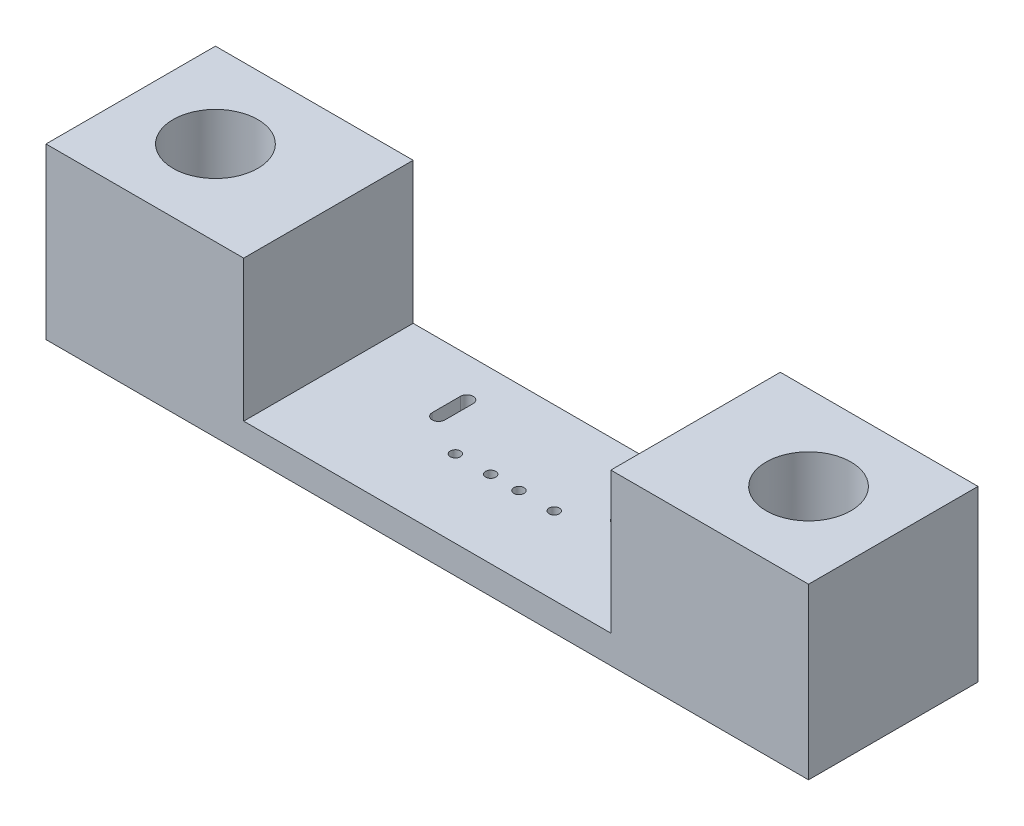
ISO-10303-21;
HEADER;
FILE_DESCRIPTION(('STEP AP214'),'2;1');
FILE_NAME('part.step','',(''),(''),'','','');
FILE_SCHEMA(('AUTOMOTIVE_DESIGN { 1 0 10303 214 1 1 1 1 }'));
ENDSEC;
DATA;
#1=APPLICATION_CONTEXT('core data for automotive mechanical design processes');
#2=APPLICATION_PROTOCOL_DEFINITION('international standard','automotive_design',2000,#1);
#3=PRODUCT_CONTEXT('',#1,'mechanical');
#4=PRODUCT('Part','Part','',(#3));
#5=PRODUCT_RELATED_PRODUCT_CATEGORY('part','',(#4));
#6=PRODUCT_DEFINITION_FORMATION('','',#4);
#7=PRODUCT_DEFINITION_CONTEXT('part definition',#1,'design');
#8=PRODUCT_DEFINITION('design','',#6,#7);
#9=PRODUCT_DEFINITION_SHAPE('','',#8);
#10=(LENGTH_UNIT() NAMED_UNIT(*) SI_UNIT(.MILLI.,.METRE.));
#11=(NAMED_UNIT(*) PLANE_ANGLE_UNIT() SI_UNIT($,.RADIAN.));
#12=(NAMED_UNIT(*) SI_UNIT($,.STERADIAN.) SOLID_ANGLE_UNIT());
#13=UNCERTAINTY_MEASURE_WITH_UNIT(LENGTH_MEASURE(1.E-05),#10,'distance_accuracy_value','');
#14=(GEOMETRIC_REPRESENTATION_CONTEXT(3) GLOBAL_UNCERTAINTY_ASSIGNED_CONTEXT((#13)) GLOBAL_UNIT_ASSIGNED_CONTEXT((#10,
#11,#12)) REPRESENTATION_CONTEXT('',''));
#15=CARTESIAN_POINT('',(0.,0.,0.));
#16=DIRECTION('',(0.,0.,1.));
#17=DIRECTION('',(1.,0.,0.));
#18=AXIS2_PLACEMENT_3D('',#15,#16,#17);
#19=CARTESIAN_POINT('',(0.,0.,12.));
#20=DIRECTION('',(1.,0.,0.));
#21=DIRECTION('',(0.,0.,-1.));
#22=AXIS2_PLACEMENT_3D('',#19,#20,#21);
#23=PLANE('',#22);
#24=DIRECTION('',(0.,-1.,0.));
#25=VECTOR('',#24,1.);
#26=CARTESIAN_POINT('',(0.,0.,0.));
#27=LINE('',#26,#25);
#28=CARTESIAN_POINT('',(0.,12.,0.));
#29=VERTEX_POINT('',#28);
#30=CARTESIAN_POINT('',(0.,0.,0.));
#31=VERTEX_POINT('',#30);
#32=EDGE_CURVE('E196',#29,#31,#27,.T.);
#33=ORIENTED_EDGE('',*,*,#32,.T.);
#34=DIRECTION('',(0.,0.,-1.));
#35=VECTOR('',#34,1.);
#36=CARTESIAN_POINT('',(0.,0.,12.));
#37=LINE('',#36,#35);
#38=CARTESIAN_POINT('',(0.,0.,12.));
#39=VERTEX_POINT('',#38);
#40=EDGE_CURVE('E258',#39,#31,#37,.T.);
#41=ORIENTED_EDGE('',*,*,#40,.F.);
#42=DIRECTION('',(0.,-1.,0.));
#43=VECTOR('',#42,1.);
#44=CARTESIAN_POINT('',(0.,0.,12.));
#45=LINE('',#44,#43);
#46=CARTESIAN_POINT('',(0.,12.,12.));
#47=VERTEX_POINT('',#46);
#48=EDGE_CURVE('E204',#47,#39,#45,.T.);
#49=ORIENTED_EDGE('',*,*,#48,.F.);
#50=DIRECTION('',(0.,0.,-1.));
#51=VECTOR('',#50,1.);
#52=CARTESIAN_POINT('',(0.,12.,12.));
#53=LINE('',#52,#51);
#54=EDGE_CURVE('E222',#47,#29,#53,.T.);
#55=ORIENTED_EDGE('',*,*,#54,.T.);
#56=EDGE_LOOP('',(#33,#41,#49,#55));
#57=FACE_BOUND('',#56,.T.);
#58=ADVANCED_FACE('F33',(#57),#23,.F.);
#59=CARTESIAN_POINT('',(0.,0.,12.));
#60=DIRECTION('',(0.,1.,0.));
#61=DIRECTION('',(0.,0.,1.));
#62=AXIS2_PLACEMENT_3D('',#59,#60,#61);
#63=PLANE('',#62);
#64=CARTESIAN_POINT('',(48.,0.,6.00000000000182));
#65=DIRECTION('',(0.,-1.,0.));
#66=DIRECTION('',(0.,0.,-1.));
#67=AXIS2_PLACEMENT_3D('',#64,#65,#66);
#68=CIRCLE('',#67,3.25);
#69=CARTESIAN_POINT('',(48.,0.,2.75000000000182));
#70=VERTEX_POINT('',#69);
#71=EDGE_CURVE('E317',#70,#70,#68,.T.);
#72=ORIENTED_EDGE('',*,*,#71,.F.);
#73=EDGE_LOOP('',(#72));
#74=FACE_BOUND('',#73,.T.);
#75=CARTESIAN_POINT('',(6.,0.,6.));
#76=DIRECTION('',(0.,-1.,0.));
#77=DIRECTION('',(0.,0.,-1.));
#78=AXIS2_PLACEMENT_3D('',#75,#76,#77);
#79=CIRCLE('',#78,3.25);
#80=CARTESIAN_POINT('',(6.,0.,2.75));
#81=VERTEX_POINT('',#80);
#82=EDGE_CURVE('E308',#81,#81,#79,.T.);
#83=ORIENTED_EDGE('',*,*,#82,.F.);
#84=EDGE_LOOP('',(#83));
#85=FACE_BOUND('',#84,.T.);
#86=CARTESIAN_POINT('',(23.5,0.,6.50999999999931));
#87=DIRECTION('',(0.,1.,0.));
#88=DIRECTION('',(0.,0.,1.));
#89=AXIS2_PLACEMENT_3D('',#86,#87,#88);
#90=CIRCLE('',#89,0.359999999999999);
#91=CARTESIAN_POINT('',(23.5,0.,6.86999999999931));
#92=VERTEX_POINT('',#91);
#93=EDGE_CURVE('E294',#92,#92,#90,.T.);
#94=ORIENTED_EDGE('',*,*,#93,.T.);
#95=EDGE_LOOP('',(#94));
#96=FACE_BOUND('',#95,.T.);
#97=CARTESIAN_POINT('',(26.,0.,6.50999999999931));
#98=DIRECTION('',(0.,1.,0.));
#99=DIRECTION('',(0.,0.,1.));
#100=AXIS2_PLACEMENT_3D('',#97,#98,#99);
#101=CIRCLE('',#100,0.359999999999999);
#102=CARTESIAN_POINT('',(26.,0.,6.86999999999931));
#103=VERTEX_POINT('',#102);
#104=EDGE_CURVE('E285',#103,#103,#101,.T.);
#105=ORIENTED_EDGE('',*,*,#104,.T.);
#106=EDGE_LOOP('',(#105));
#107=FACE_BOUND('',#106,.T.);
#108=CARTESIAN_POINT('',(28.,0.,6.50999999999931));
#109=DIRECTION('',(0.,1.,0.));
#110=DIRECTION('',(0.,0.,1.));
#111=AXIS2_PLACEMENT_3D('',#108,#109,#110);
#112=CIRCLE('',#111,0.359999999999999);
#113=CARTESIAN_POINT('',(28.,0.,6.86999999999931));
#114=VERTEX_POINT('',#113);
#115=EDGE_CURVE('E282',#114,#114,#112,.T.);
#116=ORIENTED_EDGE('',*,*,#115,.T.);
#117=EDGE_LOOP('',(#116));
#118=FACE_BOUND('',#117,.T.);
#119=CARTESIAN_POINT('',(30.5,0.,6.50999999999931));
#120=DIRECTION('',(0.,1.,0.));
#121=DIRECTION('',(0.,0.,1.));
#122=AXIS2_PLACEMENT_3D('',#119,#120,#121);
#123=CIRCLE('',#122,0.359999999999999);
#124=CARTESIAN_POINT('',(30.5,0.,6.86999999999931));
#125=VERTEX_POINT('',#124);
#126=EDGE_CURVE('E167',#125,#125,#123,.T.);
#127=ORIENTED_EDGE('',*,*,#126,.T.);
#128=EDGE_LOOP('',(#127));
#129=FACE_BOUND('',#128,.T.);
#130=DIRECTION('',(0.,0.,1.));
#131=VECTOR('',#130,1.);
#132=CARTESIAN_POINT('',(20.1499999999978,0.,4.80000000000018));
#133=LINE('',#132,#131);
#134=CARTESIAN_POINT('',(20.1499999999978,0.,2.80000000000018));
#135=VERTEX_POINT('',#134);
#136=CARTESIAN_POINT('',(20.1499999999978,0.,4.80000000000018));
#137=VERTEX_POINT('',#136);
#138=EDGE_CURVE('E154',#135,#137,#133,.T.);
#139=ORIENTED_EDGE('',*,*,#138,.T.);
#140=CARTESIAN_POINT('',(20.5999999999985,0.,4.80000000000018));
#141=DIRECTION('',(0.,1.,0.));
#142=DIRECTION('',(0.,0.,1.));
#143=AXIS2_PLACEMENT_3D('',#140,#141,#142);
#144=CIRCLE('',#143,0.450000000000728);
#145=CARTESIAN_POINT('',(21.0499999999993,0.,4.80000000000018));
#146=VERTEX_POINT('',#145);
#147=EDGE_CURVE('E150',#137,#146,#144,.T.);
#148=ORIENTED_EDGE('',*,*,#147,.T.);
#149=DIRECTION('',(0.,0.,-1.));
#150=VECTOR('',#149,1.);
#151=CARTESIAN_POINT('',(21.0499999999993,0.,4.80000000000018));
#152=LINE('',#151,#150);
#153=CARTESIAN_POINT('',(21.0499999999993,0.,2.80000000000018));
#154=VERTEX_POINT('',#153);
#155=EDGE_CURVE('E157',#146,#154,#152,.T.);
#156=ORIENTED_EDGE('',*,*,#155,.T.);
#157=CARTESIAN_POINT('',(20.5999999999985,0.,2.80000000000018));
#158=DIRECTION('',(0.,1.,0.));
#159=DIRECTION('',(0.,0.,1.));
#160=AXIS2_PLACEMENT_3D('',#157,#158,#159);
#161=CIRCLE('',#160,0.450000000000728);
#162=EDGE_CURVE('E49',#154,#135,#161,.T.);
#163=ORIENTED_EDGE('',*,*,#162,.T.);
#164=EDGE_LOOP('',(#139,#148,#156,#163));
#165=FACE_BOUND('',#164,.T.);
#166=DIRECTION('',(0.,0.,1.));
#167=VECTOR('',#166,1.);
#168=CARTESIAN_POINT('',(32.9499999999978,0.,4.80000000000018));
#169=LINE('',#168,#167);
#170=CARTESIAN_POINT('',(32.9499999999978,0.,2.80000000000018));
#171=VERTEX_POINT('',#170);
#172=CARTESIAN_POINT('',(32.9499999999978,0.,4.80000000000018));
#173=VERTEX_POINT('',#172);
#174=EDGE_CURVE('E189',#171,#173,#169,.T.);
#175=ORIENTED_EDGE('',*,*,#174,.T.);
#176=CARTESIAN_POINT('',(33.3999999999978,0.,4.80000000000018));
#177=DIRECTION('',(0.,1.,0.));
#178=DIRECTION('',(0.,0.,1.));
#179=AXIS2_PLACEMENT_3D('',#176,#177,#178);
#180=CIRCLE('',#179,0.450000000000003);
#181=CARTESIAN_POINT('',(33.8499999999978,0.,4.80000000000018));
#182=VERTEX_POINT('',#181);
#183=EDGE_CURVE('E176',#173,#182,#180,.T.);
#184=ORIENTED_EDGE('',*,*,#183,.T.);
#185=DIRECTION('',(0.,0.,-1.));
#186=VECTOR('',#185,1.);
#187=CARTESIAN_POINT('',(33.8499999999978,0.,4.80000000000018));
#188=LINE('',#187,#186);
#189=CARTESIAN_POINT('',(33.8499999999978,0.,2.80000000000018));
#190=VERTEX_POINT('',#189);
#191=EDGE_CURVE('E183',#182,#190,#188,.T.);
#192=ORIENTED_EDGE('',*,*,#191,.T.);
#193=CARTESIAN_POINT('',(33.3999999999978,0.,2.80000000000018));
#194=DIRECTION('',(0.,1.,0.));
#195=DIRECTION('',(0.,0.,1.));
#196=AXIS2_PLACEMENT_3D('',#193,#194,#195);
#197=CIRCLE('',#196,0.450000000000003);
#198=EDGE_CURVE('E186',#190,#171,#197,.T.);
#199=ORIENTED_EDGE('',*,*,#198,.T.);
#200=EDGE_LOOP('',(#175,#184,#192,#199));
#201=FACE_BOUND('',#200,.T.);
#202=DIRECTION('',(1.,0.,0.));
#203=VECTOR('',#202,1.);
#204=CARTESIAN_POINT('',(0.,0.,0.));
#205=LINE('',#204,#203);
#206=CARTESIAN_POINT('',(54.,0.,0.));
#207=VERTEX_POINT('',#206);
#208=EDGE_CURVE('E225',#31,#207,#205,.T.);
#209=ORIENTED_EDGE('',*,*,#208,.T.);
#210=DIRECTION('',(0.,0.,-1.));
#211=VECTOR('',#210,1.);
#212=CARTESIAN_POINT('',(54.,0.,12.));
#213=LINE('',#212,#211);
#214=CARTESIAN_POINT('',(54.,0.,12.));
#215=VERTEX_POINT('',#214);
#216=EDGE_CURVE('E255',#215,#207,#213,.T.);
#217=ORIENTED_EDGE('',*,*,#216,.F.);
#218=DIRECTION('',(1.,0.,0.));
#219=VECTOR('',#218,1.);
#220=CARTESIAN_POINT('',(0.,0.,12.));
#221=LINE('',#220,#219);
#222=EDGE_CURVE('E207',#39,#215,#221,.T.);
#223=ORIENTED_EDGE('',*,*,#222,.F.);
#224=ORIENTED_EDGE('',*,*,#40,.T.);
#225=EDGE_LOOP('',(#209,#217,#223,#224));
#226=FACE_BOUND('',#225,.T.);
#227=ADVANCED_FACE('F161',(#74,#85,#96,#107,#118,#129,#165,#201,#226),#63,.F.);
#228=CARTESIAN_POINT('',(54.,0.,12.));
#229=DIRECTION('',(-1.,0.,0.));
#230=DIRECTION('',(0.,0.,1.));
#231=AXIS2_PLACEMENT_3D('',#228,#229,#230);
#232=PLANE('',#231);
#233=DIRECTION('',(0.,1.,0.));
#234=VECTOR('',#233,1.);
#235=CARTESIAN_POINT('',(54.,0.,0.));
#236=LINE('',#235,#234);
#237=CARTESIAN_POINT('',(54.,12.,0.));
#238=VERTEX_POINT('',#237);
#239=EDGE_CURVE('E227',#207,#238,#236,.T.);
#240=ORIENTED_EDGE('',*,*,#239,.T.);
#241=DIRECTION('',(0.,0.,-1.));
#242=VECTOR('',#241,1.);
#243=CARTESIAN_POINT('',(54.,12.,12.));
#244=LINE('',#243,#242);
#245=CARTESIAN_POINT('',(54.,12.,12.));
#246=VERTEX_POINT('',#245);
#247=EDGE_CURVE('E252',#246,#238,#244,.T.);
#248=ORIENTED_EDGE('',*,*,#247,.F.);
#249=DIRECTION('',(0.,1.,0.));
#250=VECTOR('',#249,1.);
#251=CARTESIAN_POINT('',(54.,0.,12.));
#252=LINE('',#251,#250);
#253=EDGE_CURVE('E210',#215,#246,#252,.T.);
#254=ORIENTED_EDGE('',*,*,#253,.F.);
#255=ORIENTED_EDGE('',*,*,#216,.T.);
#256=EDGE_LOOP('',(#240,#248,#254,#255));
#257=FACE_BOUND('',#256,.T.);
#258=ADVANCED_FACE('F334',(#257),#232,.F.);
#259=CARTESIAN_POINT('',(40.,12.,12.));
#260=DIRECTION('',(0.,-1.,0.));
#261=DIRECTION('',(0.,0.,-1.));
#262=AXIS2_PLACEMENT_3D('',#259,#260,#261);
#263=PLANE('',#262);
#264=CARTESIAN_POINT('',(48.,12.,6.00000000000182));
#265=DIRECTION('',(0.,1.,0.));
#266=DIRECTION('',(0.,0.,1.));
#267=AXIS2_PLACEMENT_3D('',#264,#265,#266);
#268=CIRCLE('',#267,3.);
#269=CARTESIAN_POINT('',(48.,12.,9.00000000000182));
#270=VERTEX_POINT('',#269);
#271=EDGE_CURVE('E301',#270,#270,#268,.T.);
#272=ORIENTED_EDGE('',*,*,#271,.F.);
#273=EDGE_LOOP('',(#272));
#274=FACE_BOUND('',#273,.T.);
#275=DIRECTION('',(-1.,0.,0.));
#276=VECTOR('',#275,1.);
#277=CARTESIAN_POINT('',(40.,12.,0.));
#278=LINE('',#277,#276);
#279=CARTESIAN_POINT('',(40.,12.,0.));
#280=VERTEX_POINT('',#279);
#281=EDGE_CURVE('E229',#238,#280,#278,.T.);
#282=ORIENTED_EDGE('',*,*,#281,.T.);
#283=DIRECTION('',(0.,0.,-1.));
#284=VECTOR('',#283,1.);
#285=CARTESIAN_POINT('',(40.,12.,12.));
#286=LINE('',#285,#284);
#287=CARTESIAN_POINT('',(40.,12.,12.));
#288=VERTEX_POINT('',#287);
#289=EDGE_CURVE('E249',#288,#280,#286,.T.);
#290=ORIENTED_EDGE('',*,*,#289,.F.);
#291=DIRECTION('',(-1.,0.,0.));
#292=VECTOR('',#291,1.);
#293=CARTESIAN_POINT('',(40.,12.,12.));
#294=LINE('',#293,#292);
#295=EDGE_CURVE('E212',#246,#288,#294,.T.);
#296=ORIENTED_EDGE('',*,*,#295,.F.);
#297=ORIENTED_EDGE('',*,*,#247,.T.);
#298=EDGE_LOOP('',(#282,#290,#296,#297));
#299=FACE_BOUND('',#298,.T.);
#300=ADVANCED_FACE('F390',(#274,#299),#263,.F.);
#301=CARTESIAN_POINT('',(40.,2.,12.));
#302=DIRECTION('',(1.,0.,0.));
#303=DIRECTION('',(0.,0.,-1.));
#304=AXIS2_PLACEMENT_3D('',#301,#302,#303);
#305=PLANE('',#304);
#306=DIRECTION('',(0.,-1.,0.));
#307=VECTOR('',#306,1.);
#308=CARTESIAN_POINT('',(40.,2.,0.));
#309=LINE('',#308,#307);
#310=CARTESIAN_POINT('',(40.,2.,0.));
#311=VERTEX_POINT('',#310);
#312=EDGE_CURVE('E231',#280,#311,#309,.T.);
#313=ORIENTED_EDGE('',*,*,#312,.T.);
#314=DIRECTION('',(0.,0.,-1.));
#315=VECTOR('',#314,1.);
#316=CARTESIAN_POINT('',(40.,2.,12.));
#317=LINE('',#316,#315);
#318=CARTESIAN_POINT('',(40.,2.,12.));
#319=VERTEX_POINT('',#318);
#320=EDGE_CURVE('E246',#319,#311,#317,.T.);
#321=ORIENTED_EDGE('',*,*,#320,.F.);
#322=DIRECTION('',(0.,-1.,0.));
#323=VECTOR('',#322,1.);
#324=CARTESIAN_POINT('',(40.,2.,12.));
#325=LINE('',#324,#323);
#326=EDGE_CURVE('E214',#288,#319,#325,.T.);
#327=ORIENTED_EDGE('',*,*,#326,.F.);
#328=ORIENTED_EDGE('',*,*,#289,.T.);
#329=EDGE_LOOP('',(#313,#321,#327,#328));
#330=FACE_BOUND('',#329,.T.);
#331=ADVANCED_FACE('F355',(#330),#305,.F.);
#332=CARTESIAN_POINT('',(14.,2.,12.));
#333=DIRECTION('',(0.,-1.,0.));
#334=DIRECTION('',(0.,0.,-1.));
#335=AXIS2_PLACEMENT_3D('',#332,#333,#334);
#336=PLANE('',#335);
#337=CARTESIAN_POINT('',(23.5,2.,6.50999999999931));
#338=DIRECTION('',(0.,-1.,0.));
#339=DIRECTION('',(0.,0.,-1.));
#340=AXIS2_PLACEMENT_3D('',#337,#338,#339);
#341=CIRCLE('',#340,0.359999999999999);
#342=CARTESIAN_POINT('',(23.5,2.,6.14999999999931));
#343=VERTEX_POINT('',#342);
#344=EDGE_CURVE('E36',#343,#343,#341,.T.);
#345=ORIENTED_EDGE('',*,*,#344,.T.);
#346=EDGE_LOOP('',(#345));
#347=FACE_BOUND('',#346,.T.);
#348=CARTESIAN_POINT('',(26.,2.,6.50999999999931));
#349=DIRECTION('',(0.,-1.,0.));
#350=DIRECTION('',(0.,0.,-1.));
#351=AXIS2_PLACEMENT_3D('',#348,#349,#350);
#352=CIRCLE('',#351,0.359999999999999);
#353=CARTESIAN_POINT('',(26.,2.,6.14999999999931));
#354=VERTEX_POINT('',#353);
#355=EDGE_CURVE('E283',#354,#354,#352,.T.);
#356=ORIENTED_EDGE('',*,*,#355,.T.);
#357=EDGE_LOOP('',(#356));
#358=FACE_BOUND('',#357,.T.);
#359=CARTESIAN_POINT('',(28.,2.,6.50999999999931));
#360=DIRECTION('',(0.,-1.,0.));
#361=DIRECTION('',(0.,0.,-1.));
#362=AXIS2_PLACEMENT_3D('',#359,#360,#361);
#363=CIRCLE('',#362,0.359999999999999);
#364=CARTESIAN_POINT('',(28.,2.,6.14999999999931));
#365=VERTEX_POINT('',#364);
#366=EDGE_CURVE('E280',#365,#365,#363,.T.);
#367=ORIENTED_EDGE('',*,*,#366,.T.);
#368=EDGE_LOOP('',(#367));
#369=FACE_BOUND('',#368,.T.);
#370=CARTESIAN_POINT('',(30.5,2.,6.50999999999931));
#371=DIRECTION('',(0.,-1.,0.));
#372=DIRECTION('',(0.,0.,-1.));
#373=AXIS2_PLACEMENT_3D('',#370,#371,#372);
#374=CIRCLE('',#373,0.359999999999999);
#375=CARTESIAN_POINT('',(30.5,2.,6.14999999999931));
#376=VERTEX_POINT('',#375);
#377=EDGE_CURVE('E164',#376,#376,#374,.T.);
#378=ORIENTED_EDGE('',*,*,#377,.T.);
#379=EDGE_LOOP('',(#378));
#380=FACE_BOUND('',#379,.T.);
#381=DIRECTION('',(0.,0.,1.));
#382=VECTOR('',#381,1.);
#383=CARTESIAN_POINT('',(21.0499999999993,2.,12.));
#384=LINE('',#383,#382);
#385=CARTESIAN_POINT('',(21.0499999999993,2.,2.80000000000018));
#386=VERTEX_POINT('',#385);
#387=CARTESIAN_POINT('',(21.0499999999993,2.,4.80000000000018));
#388=VERTEX_POINT('',#387);
#389=EDGE_CURVE('E273',#386,#388,#384,.T.);
#390=ORIENTED_EDGE('',*,*,#389,.T.);
#391=CARTESIAN_POINT('',(20.5999999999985,2.,4.80000000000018));
#392=DIRECTION('',(0.,-1.,0.));
#393=DIRECTION('',(0.,0.,-1.));
#394=AXIS2_PLACEMENT_3D('',#391,#392,#393);
#395=CIRCLE('',#394,0.450000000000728);
#396=CARTESIAN_POINT('',(20.1499999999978,2.,4.80000000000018));
#397=VERTEX_POINT('',#396);
#398=EDGE_CURVE('E12',#388,#397,#395,.T.);
#399=ORIENTED_EDGE('',*,*,#398,.T.);
#400=DIRECTION('',(0.,0.,-1.));
#401=VECTOR('',#400,1.);
#402=CARTESIAN_POINT('',(20.1499999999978,2.,12.));
#403=LINE('',#402,#401);
#404=CARTESIAN_POINT('',(20.1499999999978,2.,2.80000000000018));
#405=VERTEX_POINT('',#404);
#406=EDGE_CURVE('E41',#397,#405,#403,.T.);
#407=ORIENTED_EDGE('',*,*,#406,.T.);
#408=CARTESIAN_POINT('',(20.5999999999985,2.,2.80000000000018));
#409=DIRECTION('',(0.,-1.,0.));
#410=DIRECTION('',(0.,0.,-1.));
#411=AXIS2_PLACEMENT_3D('',#408,#409,#410);
#412=CIRCLE('',#411,0.450000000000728);
#413=EDGE_CURVE('E275',#405,#386,#412,.T.);
#414=ORIENTED_EDGE('',*,*,#413,.T.);
#415=EDGE_LOOP('',(#390,#399,#407,#414));
#416=FACE_BOUND('',#415,.T.);
#417=DIRECTION('',(0.,0.,1.));
#418=VECTOR('',#417,1.);
#419=CARTESIAN_POINT('',(33.8499999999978,2.,12.));
#420=LINE('',#419,#418);
#421=CARTESIAN_POINT('',(33.8499999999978,2.,2.80000000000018));
#422=VERTEX_POINT('',#421);
#423=CARTESIAN_POINT('',(33.8499999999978,2.,4.80000000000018));
#424=VERTEX_POINT('',#423);
#425=EDGE_CURVE('E261',#422,#424,#420,.T.);
#426=ORIENTED_EDGE('',*,*,#425,.T.);
#427=CARTESIAN_POINT('',(33.3999999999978,2.,4.80000000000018));
#428=DIRECTION('',(0.,-1.,0.));
#429=DIRECTION('',(0.,0.,-1.));
#430=AXIS2_PLACEMENT_3D('',#427,#428,#429);
#431=CIRCLE('',#430,0.450000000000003);
#432=CARTESIAN_POINT('',(32.9499999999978,2.,4.80000000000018));
#433=VERTEX_POINT('',#432);
#434=EDGE_CURVE('E270',#424,#433,#431,.T.);
#435=ORIENTED_EDGE('',*,*,#434,.T.);
#436=DIRECTION('',(0.,0.,-1.));
#437=VECTOR('',#436,1.);
#438=CARTESIAN_POINT('',(32.9499999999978,2.,12.));
#439=LINE('',#438,#437);
#440=CARTESIAN_POINT('',(32.9499999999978,2.,2.80000000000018));
#441=VERTEX_POINT('',#440);
#442=EDGE_CURVE('E267',#433,#441,#439,.T.);
#443=ORIENTED_EDGE('',*,*,#442,.T.);
#444=CARTESIAN_POINT('',(33.3999999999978,2.,2.80000000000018));
#445=DIRECTION('',(0.,-1.,0.));
#446=DIRECTION('',(0.,0.,-1.));
#447=AXIS2_PLACEMENT_3D('',#444,#445,#446);
#448=CIRCLE('',#447,0.450000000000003);
#449=EDGE_CURVE('E264',#441,#422,#448,.T.);
#450=ORIENTED_EDGE('',*,*,#449,.T.);
#451=EDGE_LOOP('',(#426,#435,#443,#450));
#452=FACE_BOUND('',#451,.T.);
#453=DIRECTION('',(-1.,0.,0.));
#454=VECTOR('',#453,1.);
#455=CARTESIAN_POINT('',(14.,2.,0.));
#456=LINE('',#455,#454);
#457=CARTESIAN_POINT('',(14.,2.,0.));
#458=VERTEX_POINT('',#457);
#459=EDGE_CURVE('E233',#311,#458,#456,.T.);
#460=ORIENTED_EDGE('',*,*,#459,.T.);
#461=DIRECTION('',(0.,0.,-1.));
#462=VECTOR('',#461,1.);
#463=CARTESIAN_POINT('',(14.,2.,12.));
#464=LINE('',#463,#462);
#465=CARTESIAN_POINT('',(14.,2.,12.));
#466=VERTEX_POINT('',#465);
#467=EDGE_CURVE('E243',#466,#458,#464,.T.);
#468=ORIENTED_EDGE('',*,*,#467,.F.);
#469=DIRECTION('',(-1.,0.,0.));
#470=VECTOR('',#469,1.);
#471=CARTESIAN_POINT('',(14.,2.,12.));
#472=LINE('',#471,#470);
#473=EDGE_CURVE('E216',#319,#466,#472,.T.);
#474=ORIENTED_EDGE('',*,*,#473,.F.);
#475=ORIENTED_EDGE('',*,*,#320,.T.);
#476=EDGE_LOOP('',(#460,#468,#474,#475));
#477=FACE_BOUND('',#476,.T.);
#478=ADVANCED_FACE('F351',(#347,#358,#369,#380,#416,#452,#477),#336,.F.);
#479=CARTESIAN_POINT('',(14.,2.,12.));
#480=DIRECTION('',(-1.,0.,0.));
#481=DIRECTION('',(0.,0.,1.));
#482=AXIS2_PLACEMENT_3D('',#479,#480,#481);
#483=PLANE('',#482);
#484=DIRECTION('',(0.,1.,0.));
#485=VECTOR('',#484,1.);
#486=CARTESIAN_POINT('',(14.,2.,0.));
#487=LINE('',#486,#485);
#488=CARTESIAN_POINT('',(14.,12.,0.));
#489=VERTEX_POINT('',#488);
#490=EDGE_CURVE('E235',#458,#489,#487,.T.);
#491=ORIENTED_EDGE('',*,*,#490,.T.);
#492=DIRECTION('',(0.,0.,-1.));
#493=VECTOR('',#492,1.);
#494=CARTESIAN_POINT('',(14.,12.,12.));
#495=LINE('',#494,#493);
#496=CARTESIAN_POINT('',(14.,12.,12.));
#497=VERTEX_POINT('',#496);
#498=EDGE_CURVE('E240',#497,#489,#495,.T.);
#499=ORIENTED_EDGE('',*,*,#498,.F.);
#500=DIRECTION('',(0.,1.,0.));
#501=VECTOR('',#500,1.);
#502=CARTESIAN_POINT('',(14.,2.,12.));
#503=LINE('',#502,#501);
#504=EDGE_CURVE('E218',#466,#497,#503,.T.);
#505=ORIENTED_EDGE('',*,*,#504,.F.);
#506=ORIENTED_EDGE('',*,*,#467,.T.);
#507=EDGE_LOOP('',(#491,#499,#505,#506));
#508=FACE_BOUND('',#507,.T.);
#509=ADVANCED_FACE('F354',(#508),#483,.F.);
#510=CARTESIAN_POINT('',(0.,12.,12.));
#511=DIRECTION('',(0.,-1.,0.));
#512=DIRECTION('',(0.,0.,-1.));
#513=AXIS2_PLACEMENT_3D('',#510,#511,#512);
#514=PLANE('',#513);
#515=CARTESIAN_POINT('',(6.,12.,6.));
#516=DIRECTION('',(0.,1.,0.));
#517=DIRECTION('',(0.,0.,1.));
#518=AXIS2_PLACEMENT_3D('',#515,#516,#517);
#519=CIRCLE('',#518,3.);
#520=CARTESIAN_POINT('',(6.,12.,9.));
#521=VERTEX_POINT('',#520);
#522=EDGE_CURVE('E298',#521,#521,#519,.T.);
#523=ORIENTED_EDGE('',*,*,#522,.F.);
#524=EDGE_LOOP('',(#523));
#525=FACE_BOUND('',#524,.T.);
#526=DIRECTION('',(-1.,0.,0.));
#527=VECTOR('',#526,1.);
#528=CARTESIAN_POINT('',(0.,12.,0.));
#529=LINE('',#528,#527);
#530=EDGE_CURVE('E208',#489,#29,#529,.T.);
#531=ORIENTED_EDGE('',*,*,#530,.T.);
#532=ORIENTED_EDGE('',*,*,#54,.F.);
#533=DIRECTION('',(-1.,0.,0.));
#534=VECTOR('',#533,1.);
#535=CARTESIAN_POINT('',(0.,12.,12.));
#536=LINE('',#535,#534);
#537=EDGE_CURVE('E220',#497,#47,#536,.T.);
#538=ORIENTED_EDGE('',*,*,#537,.F.);
#539=ORIENTED_EDGE('',*,*,#498,.T.);
#540=EDGE_LOOP('',(#531,#532,#538,#539));
#541=FACE_BOUND('',#540,.T.);
#542=ADVANCED_FACE('F375',(#525,#541),#514,.F.);
#543=CARTESIAN_POINT('',(0.,12.,12.));
#544=DIRECTION('',(0.,0.,-1.));
#545=DIRECTION('',(-1.,0.,0.));
#546=AXIS2_PLACEMENT_3D('',#543,#544,#545);
#547=PLANE('',#546);
#548=ORIENTED_EDGE('',*,*,#48,.T.);
#549=ORIENTED_EDGE('',*,*,#222,.T.);
#550=ORIENTED_EDGE('',*,*,#253,.T.);
#551=ORIENTED_EDGE('',*,*,#295,.T.);
#552=ORIENTED_EDGE('',*,*,#326,.T.);
#553=ORIENTED_EDGE('',*,*,#473,.T.);
#554=ORIENTED_EDGE('',*,*,#504,.T.);
#555=ORIENTED_EDGE('',*,*,#537,.T.);
#556=EDGE_LOOP('',(#548,#549,#550,#551,#552,#553,#554,#555));
#557=FACE_BOUND('',#556,.T.);
#558=ADVANCED_FACE('F381',(#557),#547,.F.);
#559=CARTESIAN_POINT('',(0.,12.,0.));
#560=DIRECTION('',(0.,0.,-1.));
#561=DIRECTION('',(-1.,0.,0.));
#562=AXIS2_PLACEMENT_3D('',#559,#560,#561);
#563=PLANE('',#562);
#564=ORIENTED_EDGE('',*,*,#32,.F.);
#565=ORIENTED_EDGE('',*,*,#530,.F.);
#566=ORIENTED_EDGE('',*,*,#490,.F.);
#567=ORIENTED_EDGE('',*,*,#459,.F.);
#568=ORIENTED_EDGE('',*,*,#312,.F.);
#569=ORIENTED_EDGE('',*,*,#281,.F.);
#570=ORIENTED_EDGE('',*,*,#239,.F.);
#571=ORIENTED_EDGE('',*,*,#208,.F.);
#572=EDGE_LOOP('',(#564,#565,#566,#567,#568,#569,#570,#571));
#573=FACE_BOUND('',#572,.T.);
#574=ADVANCED_FACE('F372',(#573),#563,.T.);
#575=CARTESIAN_POINT('',(33.3999999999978,0.,4.80000000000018));
#576=DIRECTION('',(0.,1.,0.));
#577=DIRECTION('',(0.,0.,1.));
#578=AXIS2_PLACEMENT_3D('',#575,#576,#577);
#579=CYLINDRICAL_SURFACE('',#578,0.450000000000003);
#580=DIRECTION('',(0.,1.,0.));
#581=VECTOR('',#580,1.);
#582=CARTESIAN_POINT('',(33.8499999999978,0.,4.80000000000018));
#583=LINE('',#582,#581);
#584=EDGE_CURVE('E192',#182,#424,#583,.T.);
#585=ORIENTED_EDGE('',*,*,#584,.F.);
#586=ORIENTED_EDGE('',*,*,#183,.F.);
#587=DIRECTION('',(0.,1.,0.));
#588=VECTOR('',#587,1.);
#589=CARTESIAN_POINT('',(32.9499999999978,0.,4.80000000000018));
#590=LINE('',#589,#588);
#591=EDGE_CURVE('E193',#173,#433,#590,.T.);
#592=ORIENTED_EDGE('',*,*,#591,.T.);
#593=ORIENTED_EDGE('',*,*,#434,.F.);
#594=EDGE_LOOP('',(#585,#586,#592,#593));
#595=FACE_BOUND('',#594,.T.);
#596=ADVANCED_FACE('F488',(#595),#579,.F.);
#597=CARTESIAN_POINT('',(32.9499999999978,0.,4.80000000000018));
#598=DIRECTION('',(-1.,0.,0.));
#599=DIRECTION('',(0.,0.,1.));
#600=AXIS2_PLACEMENT_3D('',#597,#598,#599);
#601=PLANE('',#600);
#602=ORIENTED_EDGE('',*,*,#591,.F.);
#603=ORIENTED_EDGE('',*,*,#174,.F.);
#604=DIRECTION('',(0.,1.,0.));
#605=VECTOR('',#604,1.);
#606=CARTESIAN_POINT('',(32.9499999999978,0.,2.80000000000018));
#607=LINE('',#606,#605);
#608=EDGE_CURVE('E197',#171,#441,#607,.T.);
#609=ORIENTED_EDGE('',*,*,#608,.T.);
#610=ORIENTED_EDGE('',*,*,#442,.F.);
#611=EDGE_LOOP('',(#602,#603,#609,#610));
#612=FACE_BOUND('',#611,.T.);
#613=ADVANCED_FACE('F484',(#612),#601,.F.);
#614=CARTESIAN_POINT('',(33.3999999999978,0.,2.80000000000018));
#615=DIRECTION('',(0.,1.,0.));
#616=DIRECTION('',(0.,0.,1.));
#617=AXIS2_PLACEMENT_3D('',#614,#615,#616);
#618=CYLINDRICAL_SURFACE('',#617,0.450000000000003);
#619=ORIENTED_EDGE('',*,*,#608,.F.);
#620=ORIENTED_EDGE('',*,*,#198,.F.);
#621=DIRECTION('',(0.,1.,0.));
#622=VECTOR('',#621,1.);
#623=CARTESIAN_POINT('',(33.8499999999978,0.,2.80000000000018));
#624=LINE('',#623,#622);
#625=EDGE_CURVE('E200',#190,#422,#624,.T.);
#626=ORIENTED_EDGE('',*,*,#625,.T.);
#627=ORIENTED_EDGE('',*,*,#449,.F.);
#628=EDGE_LOOP('',(#619,#620,#626,#627));
#629=FACE_BOUND('',#628,.T.);
#630=ADVANCED_FACE('F487',(#629),#618,.F.);
#631=CARTESIAN_POINT('',(33.8499999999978,0.,4.80000000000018));
#632=DIRECTION('',(1.,0.,0.));
#633=DIRECTION('',(0.,0.,-1.));
#634=AXIS2_PLACEMENT_3D('',#631,#632,#633);
#635=PLANE('',#634);
#636=ORIENTED_EDGE('',*,*,#625,.F.);
#637=ORIENTED_EDGE('',*,*,#191,.F.);
#638=ORIENTED_EDGE('',*,*,#584,.T.);
#639=ORIENTED_EDGE('',*,*,#425,.F.);
#640=EDGE_LOOP('',(#636,#637,#638,#639));
#641=FACE_BOUND('',#640,.T.);
#642=ADVANCED_FACE('F483',(#641),#635,.F.);
#643=CARTESIAN_POINT('',(20.5999999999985,0.,4.80000000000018));
#644=DIRECTION('',(0.,1.,0.));
#645=DIRECTION('',(0.,0.,1.));
#646=AXIS2_PLACEMENT_3D('',#643,#644,#645);
#647=CYLINDRICAL_SURFACE('',#646,0.450000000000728);
#648=DIRECTION('',(0.,1.,0.));
#649=VECTOR('',#648,1.);
#650=CARTESIAN_POINT('',(21.0499999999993,0.,4.80000000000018));
#651=LINE('',#650,#649);
#652=EDGE_CURVE('E57',#146,#388,#651,.T.);
#653=ORIENTED_EDGE('',*,*,#652,.F.);
#654=ORIENTED_EDGE('',*,*,#147,.F.);
#655=DIRECTION('',(0.,1.,0.));
#656=VECTOR('',#655,1.);
#657=CARTESIAN_POINT('',(20.1499999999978,0.,4.80000000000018));
#658=LINE('',#657,#656);
#659=EDGE_CURVE('E174',#137,#397,#658,.T.);
#660=ORIENTED_EDGE('',*,*,#659,.T.);
#661=ORIENTED_EDGE('',*,*,#398,.F.);
#662=EDGE_LOOP('',(#653,#654,#660,#661));
#663=FACE_BOUND('',#662,.T.);
#664=ADVANCED_FACE('F147',(#663),#647,.F.);
#665=CARTESIAN_POINT('',(20.1499999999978,0.,4.80000000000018));
#666=DIRECTION('',(-1.,0.,0.));
#667=DIRECTION('',(0.,0.,1.));
#668=AXIS2_PLACEMENT_3D('',#665,#666,#667);
#669=PLANE('',#668);
#670=ORIENTED_EDGE('',*,*,#659,.F.);
#671=ORIENTED_EDGE('',*,*,#138,.F.);
#672=DIRECTION('',(0.,1.,0.));
#673=VECTOR('',#672,1.);
#674=CARTESIAN_POINT('',(20.1499999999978,0.,2.80000000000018));
#675=LINE('',#674,#673);
#676=EDGE_CURVE('E177',#135,#405,#675,.T.);
#677=ORIENTED_EDGE('',*,*,#676,.T.);
#678=ORIENTED_EDGE('',*,*,#406,.F.);
#679=EDGE_LOOP('',(#670,#671,#677,#678));
#680=FACE_BOUND('',#679,.T.);
#681=ADVANCED_FACE('F472',(#680),#669,.F.);
#682=CARTESIAN_POINT('',(20.5999999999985,0.,2.80000000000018));
#683=DIRECTION('',(0.,1.,0.));
#684=DIRECTION('',(0.,0.,1.));
#685=AXIS2_PLACEMENT_3D('',#682,#683,#684);
#686=CYLINDRICAL_SURFACE('',#685,0.450000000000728);
#687=ORIENTED_EDGE('',*,*,#676,.F.);
#688=ORIENTED_EDGE('',*,*,#162,.F.);
#689=DIRECTION('',(0.,1.,0.));
#690=VECTOR('',#689,1.);
#691=CARTESIAN_POINT('',(21.0499999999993,0.,2.80000000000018));
#692=LINE('',#691,#690);
#693=EDGE_CURVE('E153',#154,#386,#692,.T.);
#694=ORIENTED_EDGE('',*,*,#693,.T.);
#695=ORIENTED_EDGE('',*,*,#413,.F.);
#696=EDGE_LOOP('',(#687,#688,#694,#695));
#697=FACE_BOUND('',#696,.T.);
#698=ADVANCED_FACE('F475',(#697),#686,.F.);
#699=CARTESIAN_POINT('',(21.0499999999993,0.,4.80000000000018));
#700=DIRECTION('',(1.,0.,0.));
#701=DIRECTION('',(0.,0.,-1.));
#702=AXIS2_PLACEMENT_3D('',#699,#700,#701);
#703=PLANE('',#702);
#704=ORIENTED_EDGE('',*,*,#693,.F.);
#705=ORIENTED_EDGE('',*,*,#155,.F.);
#706=ORIENTED_EDGE('',*,*,#652,.T.);
#707=ORIENTED_EDGE('',*,*,#389,.F.);
#708=EDGE_LOOP('',(#704,#705,#706,#707));
#709=FACE_BOUND('',#708,.T.);
#710=ADVANCED_FACE('F158',(#709),#703,.F.);
#711=CARTESIAN_POINT('',(30.5,0.,6.50999999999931));
#712=DIRECTION('',(0.,1.,0.));
#713=DIRECTION('',(0.,0.,1.));
#714=AXIS2_PLACEMENT_3D('',#711,#712,#713);
#715=CYLINDRICAL_SURFACE('',#714,0.359999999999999);
#716=ORIENTED_EDGE('',*,*,#126,.F.);
#717=EDGE_LOOP('',(#716));
#718=FACE_BOUND('',#717,.T.);
#719=ORIENTED_EDGE('',*,*,#377,.F.);
#720=EDGE_LOOP('',(#719));
#721=FACE_BOUND('',#720,.T.);
#722=ADVANCED_FACE('F344',(#718,#721),#715,.F.);
#723=CARTESIAN_POINT('',(28.,0.,6.50999999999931));
#724=DIRECTION('',(0.,1.,0.));
#725=DIRECTION('',(0.,0.,1.));
#726=AXIS2_PLACEMENT_3D('',#723,#724,#725);
#727=CYLINDRICAL_SURFACE('',#726,0.359999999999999);
#728=ORIENTED_EDGE('',*,*,#115,.F.);
#729=EDGE_LOOP('',(#728));
#730=FACE_BOUND('',#729,.T.);
#731=ORIENTED_EDGE('',*,*,#366,.F.);
#732=EDGE_LOOP('',(#731));
#733=FACE_BOUND('',#732,.T.);
#734=ADVANCED_FACE('F347',(#730,#733),#727,.F.);
#735=CARTESIAN_POINT('',(26.,0.,6.50999999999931));
#736=DIRECTION('',(0.,1.,0.));
#737=DIRECTION('',(0.,0.,1.));
#738=AXIS2_PLACEMENT_3D('',#735,#736,#737);
#739=CYLINDRICAL_SURFACE('',#738,0.359999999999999);
#740=ORIENTED_EDGE('',*,*,#104,.F.);
#741=EDGE_LOOP('',(#740));
#742=FACE_BOUND('',#741,.T.);
#743=ORIENTED_EDGE('',*,*,#355,.F.);
#744=EDGE_LOOP('',(#743));
#745=FACE_BOUND('',#744,.T.);
#746=ADVANCED_FACE('F464',(#742,#745),#739,.F.);
#747=CARTESIAN_POINT('',(23.5,0.,6.50999999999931));
#748=DIRECTION('',(0.,1.,0.));
#749=DIRECTION('',(0.,0.,1.));
#750=AXIS2_PLACEMENT_3D('',#747,#748,#749);
#751=CYLINDRICAL_SURFACE('',#750,0.359999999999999);
#752=ORIENTED_EDGE('',*,*,#93,.F.);
#753=EDGE_LOOP('',(#752));
#754=FACE_BOUND('',#753,.T.);
#755=ORIENTED_EDGE('',*,*,#344,.F.);
#756=EDGE_LOOP('',(#755));
#757=FACE_BOUND('',#756,.T.);
#758=ADVANCED_FACE('F460',(#754,#757),#751,.F.);
#759=CARTESIAN_POINT('',(6.,6.,6.));
#760=DIRECTION('',(0.,1.,0.));
#761=DIRECTION('',(0.,0.,1.));
#762=AXIS2_PLACEMENT_3D('',#759,#760,#761);
#763=CYLINDRICAL_SURFACE('',#762,3.);
#764=CARTESIAN_POINT('',(6.,6.,6.));
#765=DIRECTION('',(0.,-1.,0.));
#766=DIRECTION('',(0.,0.,-1.));
#767=AXIS2_PLACEMENT_3D('',#764,#765,#766);
#768=CIRCLE('',#767,3.);
#769=CARTESIAN_POINT('',(6.,6.,3.));
#770=VERTEX_POINT('',#769);
#771=EDGE_CURVE('E304',#770,#770,#768,.F.);
#772=ORIENTED_EDGE('',*,*,#771,.F.);
#773=EDGE_LOOP('',(#772));
#774=FACE_BOUND('',#773,.T.);
#775=ORIENTED_EDGE('',*,*,#522,.T.);
#776=EDGE_LOOP('',(#775));
#777=FACE_BOUND('',#776,.T.);
#778=ADVANCED_FACE('F456',(#774,#777),#763,.F.);
#779=CARTESIAN_POINT('',(48.,6.,6.00000000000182));
#780=DIRECTION('',(0.,1.,0.));
#781=DIRECTION('',(0.,0.,1.));
#782=AXIS2_PLACEMENT_3D('',#779,#780,#781);
#783=CYLINDRICAL_SURFACE('',#782,3.);
#784=CARTESIAN_POINT('',(48.,6.,6.00000000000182));
#785=DIRECTION('',(0.,-1.,0.));
#786=DIRECTION('',(0.,0.,-1.));
#787=AXIS2_PLACEMENT_3D('',#784,#785,#786);
#788=CIRCLE('',#787,3.);
#789=CARTESIAN_POINT('',(48.,6.,3.00000000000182));
#790=VERTEX_POINT('',#789);
#791=EDGE_CURVE('E311',#790,#790,#788,.F.);
#792=ORIENTED_EDGE('',*,*,#791,.F.);
#793=EDGE_LOOP('',(#792));
#794=FACE_BOUND('',#793,.T.);
#795=ORIENTED_EDGE('',*,*,#271,.T.);
#796=EDGE_LOOP('',(#795));
#797=FACE_BOUND('',#796,.T.);
#798=ADVANCED_FACE('F416',(#794,#797),#783,.F.);
#799=CARTESIAN_POINT('',(6.,6.,6.));
#800=DIRECTION('',(0.,-1.,0.));
#801=DIRECTION('',(0.,0.,-1.));
#802=AXIS2_PLACEMENT_3D('',#799,#800,#801);
#803=PLANE('',#802);
#804=CARTESIAN_POINT('',(6.,6.,6.));
#805=DIRECTION('',(0.,-1.,0.));
#806=DIRECTION('',(0.,0.,-1.));
#807=AXIS2_PLACEMENT_3D('',#804,#805,#806);
#808=CIRCLE('',#807,3.25);
#809=CARTESIAN_POINT('',(6.,6.,2.75));
#810=VERTEX_POINT('',#809);
#811=EDGE_CURVE('E307',#810,#810,#808,.T.);
#812=ORIENTED_EDGE('',*,*,#811,.T.);
#813=EDGE_LOOP('',(#812));
#814=FACE_BOUND('',#813,.T.);
#815=ORIENTED_EDGE('',*,*,#771,.T.);
#816=EDGE_LOOP('',(#815));
#817=FACE_BOUND('',#816,.T.);
#818=ADVANCED_FACE('F421',(#814,#817),#803,.T.);
#819=CARTESIAN_POINT('',(6.,6.,6.));
#820=DIRECTION('',(0.,-1.,0.));
#821=DIRECTION('',(0.,0.,-1.));
#822=AXIS2_PLACEMENT_3D('',#819,#820,#821);
#823=CYLINDRICAL_SURFACE('',#822,3.25);
#824=ORIENTED_EDGE('',*,*,#811,.F.);
#825=EDGE_LOOP('',(#824));
#826=FACE_BOUND('',#825,.T.);
#827=ORIENTED_EDGE('',*,*,#82,.T.);
#828=EDGE_LOOP('',(#827));
#829=FACE_BOUND('',#828,.T.);
#830=ADVANCED_FACE('F426',(#826,#829),#823,.F.);
#831=CARTESIAN_POINT('',(48.,6.,6.00000000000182));
#832=DIRECTION('',(0.,-1.,0.));
#833=DIRECTION('',(0.,0.,-1.));
#834=AXIS2_PLACEMENT_3D('',#831,#832,#833);
#835=PLANE('',#834);
#836=CARTESIAN_POINT('',(48.,6.,6.00000000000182));
#837=DIRECTION('',(0.,-1.,0.));
#838=DIRECTION('',(0.,0.,-1.));
#839=AXIS2_PLACEMENT_3D('',#836,#837,#838);
#840=CIRCLE('',#839,3.25);
#841=CARTESIAN_POINT('',(48.,6.,2.75000000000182));
#842=VERTEX_POINT('',#841);
#843=EDGE_CURVE('E316',#842,#842,#840,.T.);
#844=ORIENTED_EDGE('',*,*,#843,.T.);
#845=EDGE_LOOP('',(#844));
#846=FACE_BOUND('',#845,.T.);
#847=ORIENTED_EDGE('',*,*,#791,.T.);
#848=EDGE_LOOP('',(#847));
#849=FACE_BOUND('',#848,.T.);
#850=ADVANCED_FACE('F323',(#846,#849),#835,.T.);
#851=CARTESIAN_POINT('',(48.,6.,6.00000000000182));
#852=DIRECTION('',(0.,-1.,0.));
#853=DIRECTION('',(0.,0.,-1.));
#854=AXIS2_PLACEMENT_3D('',#851,#852,#853);
#855=CYLINDRICAL_SURFACE('',#854,3.25);
#856=ORIENTED_EDGE('',*,*,#843,.F.);
#857=EDGE_LOOP('',(#856));
#858=FACE_BOUND('',#857,.T.);
#859=ORIENTED_EDGE('',*,*,#71,.T.);
#860=EDGE_LOOP('',(#859));
#861=FACE_BOUND('',#860,.T.);
#862=ADVANCED_FACE('F326',(#858,#861),#855,.F.);
#863=CLOSED_SHELL('',(#58,#227,#258,#300,#331,#478,#509,#542,#558,#574,#596,#613,#630,#642,#664,
#681,#698,#710,#722,#734,#746,#758,#778,#798,#818,#830,#850,#862));
#864=MANIFOLD_SOLID_BREP('B2',#863);
#865=ADVANCED_BREP_SHAPE_REPRESENTATION('',(#18,#864),#14);
#866=SHAPE_DEFINITION_REPRESENTATION(#9,#865);
ENDSEC;
END-ISO-10303-21;
